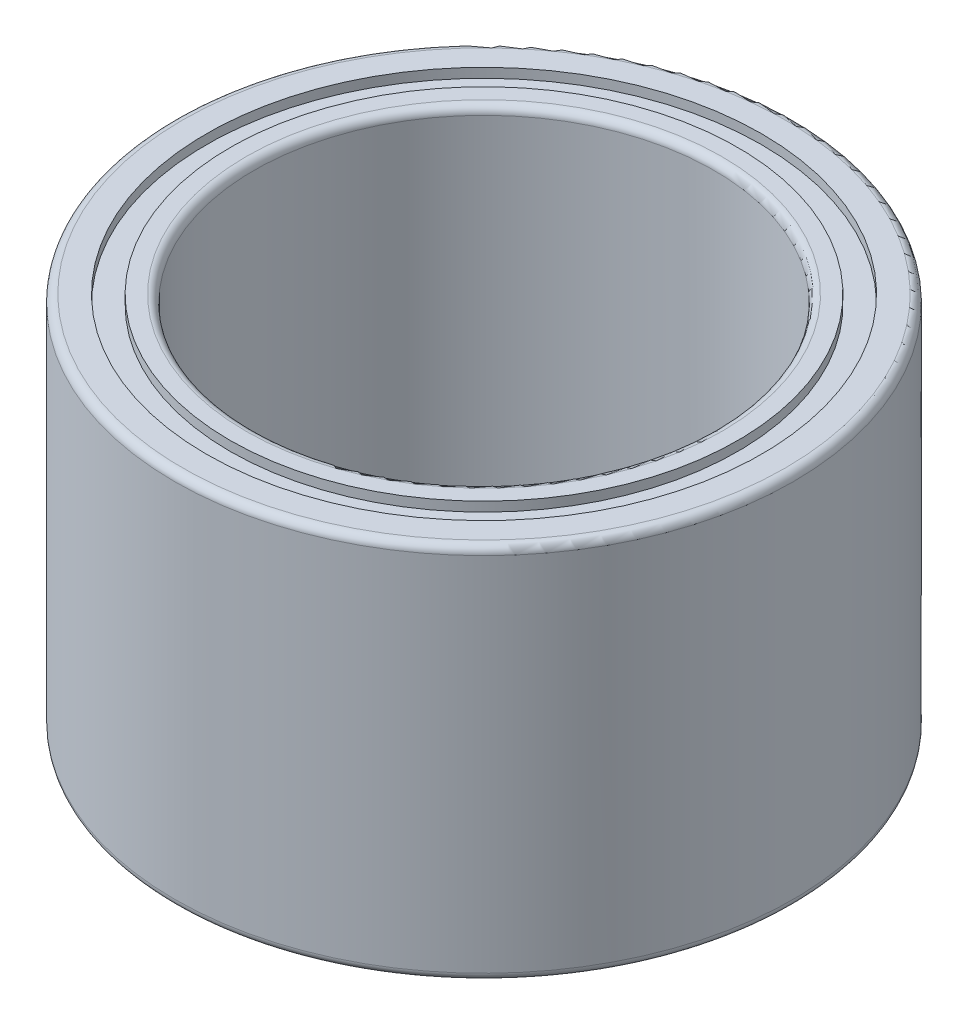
ISO-10303-21;
HEADER;
FILE_DESCRIPTION(('STEP AP214'),'2;1');
FILE_NAME('part.step','',(''),(''),'','','');
FILE_SCHEMA(('AUTOMOTIVE_DESIGN { 1 0 10303 214 1 1 1 1 }'));
ENDSEC;
DATA;
#1=APPLICATION_CONTEXT('core data for automotive mechanical design processes');
#2=APPLICATION_PROTOCOL_DEFINITION('international standard','automotive_design',2000,#1);
#3=PRODUCT_CONTEXT('',#1,'mechanical');
#4=PRODUCT('Part','Part','',(#3));
#5=PRODUCT_RELATED_PRODUCT_CATEGORY('part','',(#4));
#6=PRODUCT_DEFINITION_FORMATION('','',#4);
#7=PRODUCT_DEFINITION_CONTEXT('part definition',#1,'design');
#8=PRODUCT_DEFINITION('design','',#6,#7);
#9=PRODUCT_DEFINITION_SHAPE('','',#8);
#10=(LENGTH_UNIT() NAMED_UNIT(*) SI_UNIT(.MILLI.,.METRE.));
#11=(NAMED_UNIT(*) PLANE_ANGLE_UNIT() SI_UNIT($,.RADIAN.));
#12=(NAMED_UNIT(*) SI_UNIT($,.STERADIAN.) SOLID_ANGLE_UNIT());
#13=UNCERTAINTY_MEASURE_WITH_UNIT(LENGTH_MEASURE(1.E-05),#10,'distance_accuracy_value','');
#14=(GEOMETRIC_REPRESENTATION_CONTEXT(3) GLOBAL_UNCERTAINTY_ASSIGNED_CONTEXT((#13)) GLOBAL_UNIT_ASSIGNED_CONTEXT((#10,
#11,#12)) REPRESENTATION_CONTEXT('',''));
#15=CARTESIAN_POINT('',(0.,0.,0.));
#16=DIRECTION('',(0.,0.,1.));
#17=DIRECTION('',(1.,0.,0.));
#18=AXIS2_PLACEMENT_3D('',#15,#16,#17);
#19=CARTESIAN_POINT('',(0.,-11.9,0.));
#20=DIRECTION('',(0.,1.,0.));
#21=DIRECTION('',(0.,0.,1.));
#22=AXIS2_PLACEMENT_3D('',#19,#20,#21);
#23=CYLINDRICAL_SURFACE('',#22,14.5);
#24=CARTESIAN_POINT('',(0.,-11.4,0.));
#25=DIRECTION('',(0.,1.,0.));
#26=DIRECTION('',(0.999979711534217,0.,0.0063699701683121));
#27=AXIS2_PLACEMENT_3D('',#24,#25,#26);
#28=CIRCLE('',#27,14.5);
#29=CARTESIAN_POINT('',(14.4997058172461,-11.4,0.0923645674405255));
#30=VERTEX_POINT('',#29);
#31=EDGE_CURVE('E69',#30,#30,#28,.T.);
#32=ORIENTED_EDGE('',*,*,#31,.F.);
#33=EDGE_LOOP('',(#32));
#34=FACE_BOUND('',#33,.T.);
#35=CARTESIAN_POINT('',(0.,11.4,0.));
#36=DIRECTION('',(0.,1.,0.));
#37=DIRECTION('',(0.999959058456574,0.,-0.00904883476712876));
#38=AXIS2_PLACEMENT_3D('',#35,#36,#37);
#39=CIRCLE('',#38,14.5);
#40=CARTESIAN_POINT('',(14.4994063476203,11.4,-0.131208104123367));
#41=VERTEX_POINT('',#40);
#42=EDGE_CURVE('E131',#41,#41,#39,.F.);
#43=ORIENTED_EDGE('',*,*,#42,.F.);
#44=EDGE_LOOP('',(#43));
#45=FACE_BOUND('',#44,.T.);
#46=ADVANCED_FACE('F17',(#34,#45),#23,.F.);
#47=CARTESIAN_POINT('',(0.,11.4,0.));
#48=DIRECTION('',(0.,1.,0.));
#49=DIRECTION('',(0.999959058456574,0.,-0.00904883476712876));
#50=AXIS2_PLACEMENT_3D('',#47,#48,#49);
#51=TOROIDAL_SURFACE('',#50,15.,0.5);
#52=ORIENTED_EDGE('',*,*,#42,.T.);
#53=EDGE_LOOP('',(#52));
#54=FACE_BOUND('',#53,.T.);
#55=CARTESIAN_POINT('',(0.,11.9,0.));
#56=DIRECTION('',(0.,1.,0.));
#57=DIRECTION('',(-1.,0.,0.));
#58=AXIS2_PLACEMENT_3D('',#55,#56,#57);
#59=CIRCLE('',#58,15.);
#60=CARTESIAN_POINT('',(15.,11.9,0.));
#61=VERTEX_POINT('',#60);
#62=CARTESIAN_POINT('',(-15.,11.9,0.));
#63=VERTEX_POINT('',#62);
#64=EDGE_CURVE('E58',#61,#63,#59,.F.);
#65=ORIENTED_EDGE('',*,*,#64,.F.);
#66=CARTESIAN_POINT('',(0.,11.9,0.));
#67=DIRECTION('',(0.,1.,0.));
#68=DIRECTION('',(1.,0.,0.));
#69=AXIS2_PLACEMENT_3D('',#66,#67,#68);
#70=CIRCLE('',#69,15.);
#71=EDGE_CURVE('E56',#63,#61,#70,.F.);
#72=ORIENTED_EDGE('',*,*,#71,.F.);
#73=EDGE_LOOP('',(#65,#72));
#74=FACE_BOUND('',#73,.T.);
#75=ADVANCED_FACE('F60',(#54,#74),#51,.T.);
#76=CARTESIAN_POINT('',(0.,-11.4,0.));
#77=DIRECTION('',(0.,1.,0.));
#78=DIRECTION('',(0.999979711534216,0.,0.0063699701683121));
#79=AXIS2_PLACEMENT_3D('',#76,#77,#78);
#80=TOROIDAL_SURFACE('',#79,15.,0.5);
#81=CARTESIAN_POINT('',(0.,-11.9,0.));
#82=DIRECTION('',(0.,-1.,0.));
#83=DIRECTION('',(1.,0.,0.));
#84=AXIS2_PLACEMENT_3D('',#81,#82,#83);
#85=CIRCLE('',#84,15.);
#86=CARTESIAN_POINT('',(15.,-11.9,0.));
#87=VERTEX_POINT('',#86);
#88=CARTESIAN_POINT('',(-15.,-11.9,0.));
#89=VERTEX_POINT('',#88);
#90=EDGE_CURVE('E63',#87,#89,#85,.T.);
#91=ORIENTED_EDGE('',*,*,#90,.T.);
#92=CARTESIAN_POINT('',(0.,-11.9,0.));
#93=DIRECTION('',(0.,-1.,0.));
#94=DIRECTION('',(-1.,0.,0.));
#95=AXIS2_PLACEMENT_3D('',#92,#93,#94);
#96=CIRCLE('',#95,15.);
#97=EDGE_CURVE('E107',#89,#87,#96,.T.);
#98=ORIENTED_EDGE('',*,*,#97,.T.);
#99=EDGE_LOOP('',(#91,#98));
#100=FACE_BOUND('',#99,.T.);
#101=ORIENTED_EDGE('',*,*,#31,.T.);
#102=EDGE_LOOP('',(#101));
#103=FACE_BOUND('',#102,.T.);
#104=ADVANCED_FACE('F89',(#100,#103),#80,.T.);
#105=CARTESIAN_POINT('',(0.,11.9,0.));
#106=DIRECTION('',(0.,1.,0.));
#107=DIRECTION('',(0.,0.,1.));
#108=AXIS2_PLACEMENT_3D('',#105,#106,#107);
#109=PLANE('',#108);
#110=ORIENTED_EDGE('',*,*,#71,.T.);
#111=ORIENTED_EDGE('',*,*,#64,.T.);
#112=EDGE_LOOP('',(#110,#111));
#113=FACE_BOUND('',#112,.T.);
#114=CARTESIAN_POINT('',(0.,11.9,0.));
#115=DIRECTION('',(0.,1.,0.));
#116=DIRECTION('',(0.,0.,1.));
#117=AXIS2_PLACEMENT_3D('',#114,#115,#116);
#118=CIRCLE('',#117,16.);
#119=CARTESIAN_POINT('',(0.,11.9,16.));
#120=VERTEX_POINT('',#119);
#121=EDGE_CURVE('E157',#120,#120,#118,.F.);
#122=ORIENTED_EDGE('',*,*,#121,.F.);
#123=EDGE_LOOP('',(#122));
#124=FACE_BOUND('',#123,.T.);
#125=ADVANCED_FACE('F67',(#113,#124),#109,.T.);
#126=CARTESIAN_POINT('',(0.,-11.9,0.));
#127=DIRECTION('',(0.,1.,0.));
#128=DIRECTION('',(0.,0.,1.));
#129=AXIS2_PLACEMENT_3D('',#126,#127,#128);
#130=PLANE('',#129);
#131=ORIENTED_EDGE('',*,*,#90,.F.);
#132=ORIENTED_EDGE('',*,*,#97,.F.);
#133=EDGE_LOOP('',(#131,#132));
#134=FACE_BOUND('',#133,.T.);
#135=CARTESIAN_POINT('',(0.,-11.9,0.));
#136=DIRECTION('',(0.,1.,0.));
#137=DIRECTION('',(0.,0.,1.));
#138=AXIS2_PLACEMENT_3D('',#135,#136,#137);
#139=CIRCLE('',#138,16.);
#140=CARTESIAN_POINT('',(0.,-11.9,16.));
#141=VERTEX_POINT('',#140);
#142=EDGE_CURVE('E154',#141,#141,#139,.T.);
#143=ORIENTED_EDGE('',*,*,#142,.F.);
#144=EDGE_LOOP('',(#143));
#145=FACE_BOUND('',#144,.T.);
#146=ADVANCED_FACE('F88',(#134,#145),#130,.F.);
#147=CARTESIAN_POINT('',(0.,-13.09,0.));
#148=DIRECTION('',(0.,1.,0.));
#149=DIRECTION('',(0.,0.,1.));
#150=AXIS2_PLACEMENT_3D('',#147,#148,#149);
#151=CYLINDRICAL_SURFACE('',#150,16.);
#152=CARTESIAN_POINT('',(0.,11.3,0.));
#153=DIRECTION('',(0.,1.,0.));
#154=DIRECTION('',(0.,0.,1.));
#155=AXIS2_PLACEMENT_3D('',#152,#153,#154);
#156=CIRCLE('',#155,16.);
#157=CARTESIAN_POINT('',(0.,11.3,16.));
#158=VERTEX_POINT('',#157);
#159=EDGE_CURVE('E151',#158,#158,#156,.F.);
#160=ORIENTED_EDGE('',*,*,#159,.F.);
#161=EDGE_LOOP('',(#160));
#162=FACE_BOUND('',#161,.T.);
#163=ORIENTED_EDGE('',*,*,#121,.T.);
#164=EDGE_LOOP('',(#163));
#165=FACE_BOUND('',#164,.T.);
#166=ADVANCED_FACE('F359',(#162,#165),#151,.T.);
#167=CARTESIAN_POINT('',(0.,-13.09,0.));
#168=DIRECTION('',(0.,1.,0.));
#169=DIRECTION('',(0.,0.,1.));
#170=AXIS2_PLACEMENT_3D('',#167,#168,#169);
#171=CYLINDRICAL_SURFACE('',#170,16.);
#172=CARTESIAN_POINT('',(0.,-11.3,0.));
#173=DIRECTION('',(0.,1.,0.));
#174=DIRECTION('',(0.,0.,1.));
#175=AXIS2_PLACEMENT_3D('',#172,#173,#174);
#176=CIRCLE('',#175,16.);
#177=CARTESIAN_POINT('',(0.,-11.3,16.));
#178=VERTEX_POINT('',#177);
#179=EDGE_CURVE('E148',#178,#178,#176,.F.);
#180=ORIENTED_EDGE('',*,*,#179,.T.);
#181=EDGE_LOOP('',(#180));
#182=FACE_BOUND('',#181,.T.);
#183=ORIENTED_EDGE('',*,*,#142,.T.);
#184=EDGE_LOOP('',(#183));
#185=FACE_BOUND('',#184,.T.);
#186=ADVANCED_FACE('F351',(#182,#185),#171,.T.);
#187=CARTESIAN_POINT('',(0.,11.3,0.));
#188=DIRECTION('',(0.,1.,0.));
#189=DIRECTION('',(0.,0.,1.));
#190=AXIS2_PLACEMENT_3D('',#187,#188,#189);
#191=PLANE('',#190);
#192=ORIENTED_EDGE('',*,*,#159,.T.);
#193=EDGE_LOOP('',(#192));
#194=FACE_BOUND('',#193,.T.);
#195=CARTESIAN_POINT('',(0.,11.3,0.));
#196=DIRECTION('',(0.,1.,0.));
#197=DIRECTION('',(0.,0.,1.));
#198=AXIS2_PLACEMENT_3D('',#195,#196,#197);
#199=CIRCLE('',#198,17.5);
#200=CARTESIAN_POINT('',(0.,11.3,17.5));
#201=VERTEX_POINT('',#200);
#202=EDGE_CURVE('E145',#201,#201,#199,.T.);
#203=ORIENTED_EDGE('',*,*,#202,.T.);
#204=EDGE_LOOP('',(#203));
#205=FACE_BOUND('',#204,.T.);
#206=ADVANCED_FACE('F343',(#194,#205),#191,.T.);
#207=CARTESIAN_POINT('',(0.,-11.3,0.));
#208=DIRECTION('',(0.,1.,0.));
#209=DIRECTION('',(0.,0.,1.));
#210=AXIS2_PLACEMENT_3D('',#207,#208,#209);
#211=PLANE('',#210);
#212=ORIENTED_EDGE('',*,*,#179,.F.);
#213=EDGE_LOOP('',(#212));
#214=FACE_BOUND('',#213,.T.);
#215=CARTESIAN_POINT('',(0.,-11.3,0.));
#216=DIRECTION('',(0.,1.,0.));
#217=DIRECTION('',(0.,0.,1.));
#218=AXIS2_PLACEMENT_3D('',#215,#216,#217);
#219=CIRCLE('',#218,17.5);
#220=CARTESIAN_POINT('',(0.,-11.3,17.5));
#221=VERTEX_POINT('',#220);
#222=EDGE_CURVE('E142',#221,#221,#219,.F.);
#223=ORIENTED_EDGE('',*,*,#222,.T.);
#224=EDGE_LOOP('',(#223));
#225=FACE_BOUND('',#224,.T.);
#226=ADVANCED_FACE('F336',(#214,#225),#211,.F.);
#227=CARTESIAN_POINT('',(0.,-13.09,0.));
#228=DIRECTION('',(0.,1.,0.));
#229=DIRECTION('',(0.,0.,1.));
#230=AXIS2_PLACEMENT_3D('',#227,#228,#229);
#231=CYLINDRICAL_SURFACE('',#230,17.5);
#232=ORIENTED_EDGE('',*,*,#202,.F.);
#233=EDGE_LOOP('',(#232));
#234=FACE_BOUND('',#233,.T.);
#235=CARTESIAN_POINT('',(0.,11.9,0.));
#236=DIRECTION('',(0.,1.,0.));
#237=DIRECTION('',(0.,0.,1.));
#238=AXIS2_PLACEMENT_3D('',#235,#236,#237);
#239=CIRCLE('',#238,17.5);
#240=CARTESIAN_POINT('',(0.,11.9,17.5));
#241=VERTEX_POINT('',#240);
#242=EDGE_CURVE('E138',#241,#241,#239,.F.);
#243=ORIENTED_EDGE('',*,*,#242,.F.);
#244=EDGE_LOOP('',(#243));
#245=FACE_BOUND('',#244,.T.);
#246=ADVANCED_FACE('F329',(#234,#245),#231,.F.);
#247=CARTESIAN_POINT('',(0.,-13.09,0.));
#248=DIRECTION('',(0.,1.,0.));
#249=DIRECTION('',(0.,0.,1.));
#250=AXIS2_PLACEMENT_3D('',#247,#248,#249);
#251=CYLINDRICAL_SURFACE('',#250,17.5);
#252=ORIENTED_EDGE('',*,*,#222,.F.);
#253=EDGE_LOOP('',(#252));
#254=FACE_BOUND('',#253,.T.);
#255=CARTESIAN_POINT('',(0.,-11.9,0.));
#256=DIRECTION('',(0.,1.,0.));
#257=DIRECTION('',(0.,0.,1.));
#258=AXIS2_PLACEMENT_3D('',#255,#256,#257);
#259=CIRCLE('',#258,17.5);
#260=CARTESIAN_POINT('',(0.,-11.9,17.5));
#261=VERTEX_POINT('',#260);
#262=EDGE_CURVE('E134',#261,#261,#259,.F.);
#263=ORIENTED_EDGE('',*,*,#262,.T.);
#264=EDGE_LOOP('',(#263));
#265=FACE_BOUND('',#264,.T.);
#266=ADVANCED_FACE('F237',(#254,#265),#251,.F.);
#267=CARTESIAN_POINT('',(0.,11.9,0.));
#268=DIRECTION('',(0.,1.,0.));
#269=DIRECTION('',(0.,0.,1.));
#270=AXIS2_PLACEMENT_3D('',#267,#268,#269);
#271=PLANE('',#270);
#272=ORIENTED_EDGE('',*,*,#242,.T.);
#273=EDGE_LOOP('',(#272));
#274=FACE_BOUND('',#273,.T.);
#275=CARTESIAN_POINT('',(0.,11.9,0.));
#276=DIRECTION('',(0.,-1.,0.));
#277=DIRECTION('',(1.,0.,0.));
#278=AXIS2_PLACEMENT_3D('',#275,#276,#277);
#279=CIRCLE('',#278,19.);
#280=CARTESIAN_POINT('',(19.,11.9,0.));
#281=VERTEX_POINT('',#280);
#282=CARTESIAN_POINT('',(-19.,11.9,0.));
#283=VERTEX_POINT('',#282);
#284=EDGE_CURVE('E141',#281,#283,#279,.T.);
#285=ORIENTED_EDGE('',*,*,#284,.F.);
#286=CARTESIAN_POINT('',(0.,11.9,0.));
#287=DIRECTION('',(0.,-1.,0.));
#288=DIRECTION('',(-1.,0.,0.));
#289=AXIS2_PLACEMENT_3D('',#286,#287,#288);
#290=CIRCLE('',#289,19.);
#291=EDGE_CURVE('E137',#283,#281,#290,.T.);
#292=ORIENTED_EDGE('',*,*,#291,.F.);
#293=EDGE_LOOP('',(#285,#292));
#294=FACE_BOUND('',#293,.T.);
#295=ADVANCED_FACE('F228',(#274,#294),#271,.T.);
#296=CARTESIAN_POINT('',(0.,-11.9,0.));
#297=DIRECTION('',(0.,1.,0.));
#298=DIRECTION('',(0.,0.,1.));
#299=AXIS2_PLACEMENT_3D('',#296,#297,#298);
#300=PLANE('',#299);
#301=ORIENTED_EDGE('',*,*,#262,.F.);
#302=EDGE_LOOP('',(#301));
#303=FACE_BOUND('',#302,.T.);
#304=CARTESIAN_POINT('',(0.,-11.9,0.));
#305=DIRECTION('',(0.,1.,0.));
#306=DIRECTION('',(-1.,0.,0.));
#307=AXIS2_PLACEMENT_3D('',#304,#305,#306);
#308=CIRCLE('',#307,19.);
#309=CARTESIAN_POINT('',(-19.,-11.9,0.));
#310=VERTEX_POINT('',#309);
#311=CARTESIAN_POINT('',(19.,-11.9,0.));
#312=VERTEX_POINT('',#311);
#313=EDGE_CURVE('E35',#310,#312,#308,.T.);
#314=ORIENTED_EDGE('',*,*,#313,.F.);
#315=CARTESIAN_POINT('',(0.,-11.9,0.));
#316=DIRECTION('',(0.,1.,0.));
#317=DIRECTION('',(1.,0.,0.));
#318=AXIS2_PLACEMENT_3D('',#315,#316,#317);
#319=CIRCLE('',#318,19.);
#320=EDGE_CURVE('E203',#312,#310,#319,.T.);
#321=ORIENTED_EDGE('',*,*,#320,.F.);
#322=EDGE_LOOP('',(#314,#321));
#323=FACE_BOUND('',#322,.T.);
#324=ADVANCED_FACE('F181',(#303,#323),#300,.F.);
#325=CARTESIAN_POINT('',(0.,11.4,0.));
#326=DIRECTION('',(0.,1.,0.));
#327=DIRECTION('',(0.999988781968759,0.,0.0047366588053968));
#328=AXIS2_PLACEMENT_3D('',#325,#326,#327);
#329=TOROIDAL_SURFACE('',#328,19.,0.5);
#330=CARTESIAN_POINT('',(0.,11.4,0.));
#331=DIRECTION('',(0.,1.,0.));
#332=DIRECTION('',(0.,0.,1.));
#333=AXIS2_PLACEMENT_3D('',#330,#331,#332);
#334=CIRCLE('',#333,19.5);
#335=CARTESIAN_POINT('',(0.,11.4,19.5));
#336=VERTEX_POINT('',#335);
#337=EDGE_CURVE('E27',#336,#336,#334,.F.);
#338=ORIENTED_EDGE('',*,*,#337,.F.);
#339=EDGE_LOOP('',(#338));
#340=FACE_BOUND('',#339,.T.);
#341=ORIENTED_EDGE('',*,*,#291,.T.);
#342=ORIENTED_EDGE('',*,*,#284,.T.);
#343=EDGE_LOOP('',(#341,#342));
#344=FACE_BOUND('',#343,.T.);
#345=ADVANCED_FACE('F169',(#340,#344),#329,.T.);
#346=CARTESIAN_POINT('',(0.,-11.4,0.));
#347=DIRECTION('',(0.,1.,0.));
#348=DIRECTION('',(-0.999977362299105,0.,0.00672866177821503));
#349=AXIS2_PLACEMENT_3D('',#346,#347,#348);
#350=TOROIDAL_SURFACE('',#349,19.,0.5);
#351=CARTESIAN_POINT('',(0.,-11.4,0.));
#352=DIRECTION('',(0.,1.,0.));
#353=DIRECTION('',(0.,0.,1.));
#354=AXIS2_PLACEMENT_3D('',#351,#352,#353);
#355=CIRCLE('',#354,19.5);
#356=CARTESIAN_POINT('',(0.,-11.4,19.5));
#357=VERTEX_POINT('',#356);
#358=EDGE_CURVE('E11',#357,#357,#355,.T.);
#359=ORIENTED_EDGE('',*,*,#358,.F.);
#360=EDGE_LOOP('',(#359));
#361=FACE_BOUND('',#360,.T.);
#362=ORIENTED_EDGE('',*,*,#320,.T.);
#363=ORIENTED_EDGE('',*,*,#313,.T.);
#364=EDGE_LOOP('',(#362,#363));
#365=FACE_BOUND('',#364,.T.);
#366=ADVANCED_FACE('F180',(#361,#365),#350,.T.);
#367=CARTESIAN_POINT('',(0.,-11.9,0.));
#368=DIRECTION('',(0.,1.,0.));
#369=DIRECTION('',(0.,0.,1.));
#370=AXIS2_PLACEMENT_3D('',#367,#368,#369);
#371=CYLINDRICAL_SURFACE('',#370,19.5);
#372=ORIENTED_EDGE('',*,*,#337,.T.);
#373=EDGE_LOOP('',(#372));
#374=FACE_BOUND('',#373,.T.);
#375=ORIENTED_EDGE('',*,*,#358,.T.);
#376=EDGE_LOOP('',(#375));
#377=FACE_BOUND('',#376,.T.);
#378=ADVANCED_FACE('F293',(#374,#377),#371,.T.);
#379=CLOSED_SHELL('',(#46,#75,#104,#125,#146,#166,#186,#206,#226,#246,#266,#295,#324,#345,#366,#378));
#380=MANIFOLD_SOLID_BREP('B1',#379);
#381=ADVANCED_BREP_SHAPE_REPRESENTATION('',(#18,#380),#14);
#382=SHAPE_DEFINITION_REPRESENTATION(#9,#381);
ENDSEC;
END-ISO-10303-21;
